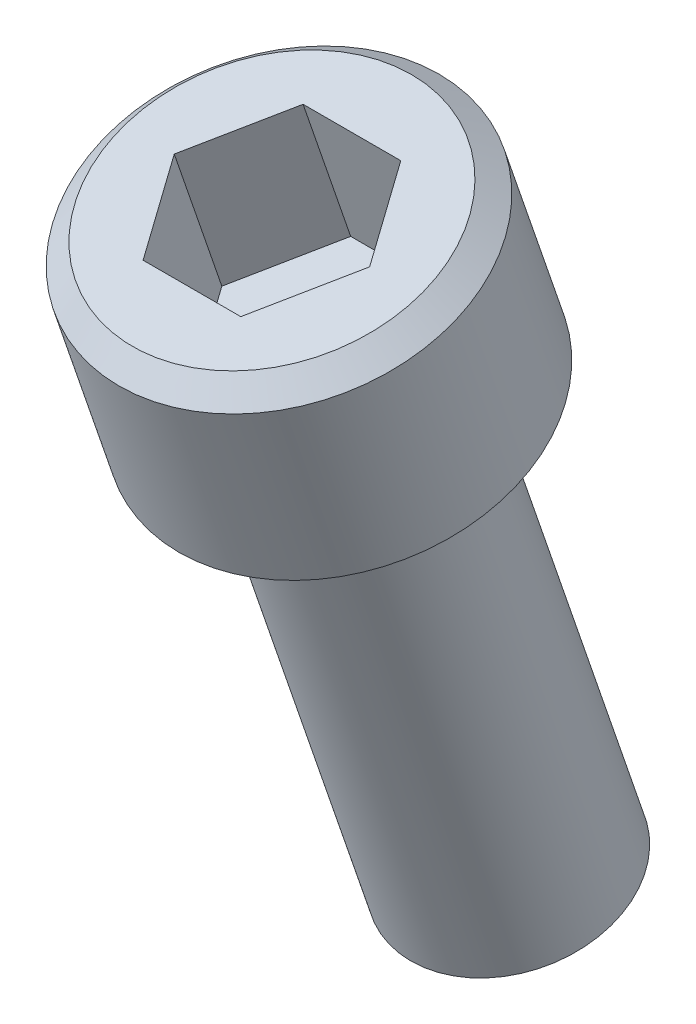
ISO-10303-21;
HEADER;
FILE_DESCRIPTION(('STEP AP214'),'2;1');
FILE_NAME('part.step','',(''),(''),'','','');
FILE_SCHEMA(('AUTOMOTIVE_DESIGN { 1 0 10303 214 1 1 1 1 }'));
ENDSEC;
DATA;
#1=APPLICATION_CONTEXT('core data for automotive mechanical design processes');
#2=APPLICATION_PROTOCOL_DEFINITION('international standard','automotive_design',2000,#1);
#3=PRODUCT_CONTEXT('',#1,'mechanical');
#4=PRODUCT('Part','Part','',(#3));
#5=PRODUCT_RELATED_PRODUCT_CATEGORY('part','',(#4));
#6=PRODUCT_DEFINITION_FORMATION('','',#4);
#7=PRODUCT_DEFINITION_CONTEXT('part definition',#1,'design');
#8=PRODUCT_DEFINITION('design','',#6,#7);
#9=PRODUCT_DEFINITION_SHAPE('','',#8);
#10=(LENGTH_UNIT() NAMED_UNIT(*) SI_UNIT(.MILLI.,.METRE.));
#11=(NAMED_UNIT(*) PLANE_ANGLE_UNIT() SI_UNIT($,.RADIAN.));
#12=(NAMED_UNIT(*) SI_UNIT($,.STERADIAN.) SOLID_ANGLE_UNIT());
#13=UNCERTAINTY_MEASURE_WITH_UNIT(LENGTH_MEASURE(1.E-05),#10,'distance_accuracy_value','');
#14=(GEOMETRIC_REPRESENTATION_CONTEXT(3) GLOBAL_UNCERTAINTY_ASSIGNED_CONTEXT((#13)) GLOBAL_UNIT_ASSIGNED_CONTEXT((#10,
#11,#12)) REPRESENTATION_CONTEXT('',''));
#15=CARTESIAN_POINT('',(0.,0.,0.));
#16=DIRECTION('',(0.,0.,1.));
#17=DIRECTION('',(1.,0.,0.));
#18=AXIS2_PLACEMENT_3D('',#15,#16,#17);
#19=CARTESIAN_POINT('',(-745.722223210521,-226.647654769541,-472.873349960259));
#20=DIRECTION('',(0.,-0.945518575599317,-0.325568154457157));
#21=DIRECTION('',(0.,0.325568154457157,-0.945518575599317));
#22=AXIS2_PLACEMENT_3D('',#19,#20,#21);
#23=PLANE('',#22);
#24=DIRECTION('',(0.500000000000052,-0.281950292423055,0.818843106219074));
#25=VECTOR('',#24,1.);
#26=CARTESIAN_POINT('',(-748.013582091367,-226.647654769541,-472.873349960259));
#27=LINE('',#26,#25);
#28=CARTESIAN_POINT('',(-748.013582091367,-226.647654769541,-472.873349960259));
#29=VERTEX_POINT('',#28);
#30=CARTESIAN_POINT('',(-746.867902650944,-227.293704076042,-470.997086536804));
#31=VERTEX_POINT('',#30);
#32=EDGE_CURVE('E142',#29,#31,#27,.T.);
#33=ORIENTED_EDGE('',*,*,#32,.T.);
#34=DIRECTION('',(1.,0.,0.));
#35=VECTOR('',#34,1.);
#36=CARTESIAN_POINT('',(-744.576543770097,-227.293704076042,-470.997086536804));
#37=LINE('',#36,#35);
#38=CARTESIAN_POINT('',(-744.576543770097,-227.293704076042,-470.997086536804));
#39=VERTEX_POINT('',#38);
#40=EDGE_CURVE('E149',#31,#39,#37,.T.);
#41=ORIENTED_EDGE('',*,*,#40,.T.);
#42=DIRECTION('',(0.500000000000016,0.281950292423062,-0.818843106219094));
#43=VECTOR('',#42,1.);
#44=CARTESIAN_POINT('',(-744.576543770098,-227.293704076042,-470.997086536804));
#45=LINE('',#44,#43);
#46=CARTESIAN_POINT('',(-743.430864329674,-226.647654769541,-472.873349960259));
#47=VERTEX_POINT('',#46);
#48=EDGE_CURVE('E153',#39,#47,#45,.T.);
#49=ORIENTED_EDGE('',*,*,#48,.T.);
#50=DIRECTION('',(-0.500000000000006,0.28195029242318,-0.818843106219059));
#51=VECTOR('',#50,1.);
#52=CARTESIAN_POINT('',(-743.430864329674,-226.647654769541,-472.873349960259));
#53=LINE('',#52,#51);
#54=CARTESIAN_POINT('',(-744.576543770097,-226.00160546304,-474.749613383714));
#55=VERTEX_POINT('',#54);
#56=EDGE_CURVE('E157',#47,#55,#53,.T.);
#57=ORIENTED_EDGE('',*,*,#56,.T.);
#58=DIRECTION('',(1.,0.,0.));
#59=VECTOR('',#58,1.);
#60=CARTESIAN_POINT('',(-746.867902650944,-226.00160546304,-474.749613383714));
#61=LINE('',#60,#59);
#62=CARTESIAN_POINT('',(-746.867902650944,-226.001605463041,-474.749613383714));
#63=VERTEX_POINT('',#62);
#64=EDGE_CURVE('E161',#55,#63,#61,.F.);
#65=ORIENTED_EDGE('',*,*,#64,.T.);
#66=DIRECTION('',(-0.499999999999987,-0.281950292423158,0.818843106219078));
#67=VECTOR('',#66,1.);
#68=CARTESIAN_POINT('',(-746.867902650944,-226.00160546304,-474.749613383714));
#69=LINE('',#68,#67);
#70=EDGE_CURVE('E163',#63,#29,#69,.T.);
#71=ORIENTED_EDGE('',*,*,#70,.T.);
#72=EDGE_LOOP('',(#33,#41,#49,#57,#65,#71));
#73=FACE_BOUND('',#72,.T.);
#74=ADVANCED_FACE('F17',(#73),#23,.F.);
#75=CARTESIAN_POINT('',(-748.013582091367,-226.647654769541,-472.873349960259));
#76=DIRECTION('',(-0.866025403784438,0.162784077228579,-0.47275928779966));
#77=DIRECTION('',(-0.47915033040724,0.,0.877732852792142));
#78=AXIS2_PLACEMENT_3D('',#75,#76,#77);
#79=PLANE('',#78);
#80=ORIENTED_EDGE('',*,*,#70,.F.);
#81=DIRECTION('',(0.,0.945518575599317,0.325568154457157));
#82=VECTOR('',#81,1.);
#83=CARTESIAN_POINT('',(-746.867902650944,-226.00160546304,-474.749613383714));
#84=LINE('',#83,#82);
#85=CARTESIAN_POINT('',(-746.867902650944,-222.75942226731,-473.63324018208));
#86=VERTEX_POINT('',#85);
#87=EDGE_CURVE('E159',#63,#86,#84,.T.);
#88=ORIENTED_EDGE('',*,*,#87,.T.);
#89=DIRECTION('',(0.500000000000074,0.281950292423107,-0.818843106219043));
#90=VECTOR('',#89,1.);
#91=CARTESIAN_POINT('',(-748.013582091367,-223.405471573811,-471.756976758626));
#92=LINE('',#91,#90);
#93=CARTESIAN_POINT('',(-748.013582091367,-223.405471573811,-471.756976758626));
#94=VERTEX_POINT('',#93);
#95=EDGE_CURVE('E137',#94,#86,#92,.T.);
#96=ORIENTED_EDGE('',*,*,#95,.F.);
#97=DIRECTION('',(0.,-0.945518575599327,-0.325568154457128));
#98=VECTOR('',#97,1.);
#99=CARTESIAN_POINT('',(-748.013582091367,-223.405471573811,-471.756976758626));
#100=LINE('',#99,#98);
#101=EDGE_CURVE('E144',#94,#29,#100,.T.);
#102=ORIENTED_EDGE('',*,*,#101,.T.);
#103=EDGE_LOOP('',(#80,#88,#96,#102));
#104=FACE_BOUND('',#103,.T.);
#105=ADVANCED_FACE('F305',(#104),#79,.F.);
#106=CARTESIAN_POINT('',(-746.867902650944,-226.00160546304,-474.749613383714));
#107=DIRECTION('',(0.,0.325568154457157,-0.945518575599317));
#108=DIRECTION('',(0.,0.945518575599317,0.325568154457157));
#109=AXIS2_PLACEMENT_3D('',#106,#107,#108);
#110=PLANE('',#109);
#111=ORIENTED_EDGE('',*,*,#64,.F.);
#112=DIRECTION('',(0.,0.945518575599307,0.325568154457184));
#113=VECTOR('',#112,1.);
#114=CARTESIAN_POINT('',(-744.576543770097,-226.00160546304,-474.749613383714));
#115=LINE('',#114,#113);
#116=CARTESIAN_POINT('',(-744.576543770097,-222.75942226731,-473.63324018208));
#117=VERTEX_POINT('',#116);
#118=EDGE_CURVE('E155',#55,#117,#115,.T.);
#119=ORIENTED_EDGE('',*,*,#118,.T.);
#120=DIRECTION('',(1.,0.,0.));
#121=VECTOR('',#120,1.);
#122=CARTESIAN_POINT('',(-745.722223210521,-222.75942226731,-473.63324018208));
#123=LINE('',#122,#121);
#124=EDGE_CURVE('E134',#86,#117,#123,.T.);
#125=ORIENTED_EDGE('',*,*,#124,.F.);
#126=ORIENTED_EDGE('',*,*,#87,.F.);
#127=EDGE_LOOP('',(#111,#119,#125,#126));
#128=FACE_BOUND('',#127,.T.);
#129=ADVANCED_FACE('F295',(#128),#110,.F.);
#130=CARTESIAN_POINT('',(-744.576543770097,-226.00160546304,-474.749613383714));
#131=DIRECTION('',(0.866025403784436,0.16278407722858,-0.472759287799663));
#132=DIRECTION('',(-0.479150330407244,0.,-0.87773285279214));
#133=AXIS2_PLACEMENT_3D('',#130,#131,#132);
#134=PLANE('',#133);
#135=ORIENTED_EDGE('',*,*,#56,.F.);
#136=DIRECTION('',(0.,0.945518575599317,0.325568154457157));
#137=VECTOR('',#136,1.);
#138=CARTESIAN_POINT('',(-743.430864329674,-226.647654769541,-472.873349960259));
#139=LINE('',#138,#137);
#140=CARTESIAN_POINT('',(-743.430864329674,-223.405471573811,-471.756976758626));
#141=VERTEX_POINT('',#140);
#142=EDGE_CURVE('E151',#47,#141,#139,.T.);
#143=ORIENTED_EDGE('',*,*,#142,.T.);
#144=DIRECTION('',(0.500000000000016,-0.281950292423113,0.818843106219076));
#145=VECTOR('',#144,1.);
#146=CARTESIAN_POINT('',(-744.576543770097,-222.75942226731,-473.63324018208));
#147=LINE('',#146,#145);
#148=EDGE_CURVE('E131',#117,#141,#147,.T.);
#149=ORIENTED_EDGE('',*,*,#148,.F.);
#150=ORIENTED_EDGE('',*,*,#118,.F.);
#151=EDGE_LOOP('',(#135,#143,#149,#150));
#152=FACE_BOUND('',#151,.T.);
#153=ADVANCED_FACE('F285',(#152),#134,.F.);
#154=CARTESIAN_POINT('',(-743.430864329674,-226.647654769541,-472.873349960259));
#155=DIRECTION('',(0.866025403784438,-0.162784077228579,0.47275928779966));
#156=DIRECTION('',(0.47915033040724,0.,-0.877732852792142));
#157=AXIS2_PLACEMENT_3D('',#154,#155,#156);
#158=PLANE('',#157);
#159=ORIENTED_EDGE('',*,*,#48,.F.);
#160=DIRECTION('',(0.,-0.945518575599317,-0.325568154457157));
#161=VECTOR('',#160,1.);
#162=CARTESIAN_POINT('',(-744.576543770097,-227.293704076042,-470.997086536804));
#163=LINE('',#162,#161);
#164=CARTESIAN_POINT('',(-744.576543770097,-224.051520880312,-469.880713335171));
#165=VERTEX_POINT('',#164);
#166=EDGE_CURVE('E147',#39,#165,#163,.F.);
#167=ORIENTED_EDGE('',*,*,#166,.T.);
#168=DIRECTION('',(-0.499999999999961,-0.281950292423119,0.818843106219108));
#169=VECTOR('',#168,1.);
#170=CARTESIAN_POINT('',(-743.430864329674,-223.405471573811,-471.756976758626));
#171=LINE('',#170,#169);
#172=EDGE_CURVE('E128',#141,#165,#171,.T.);
#173=ORIENTED_EDGE('',*,*,#172,.F.);
#174=ORIENTED_EDGE('',*,*,#142,.F.);
#175=EDGE_LOOP('',(#159,#167,#173,#174));
#176=FACE_BOUND('',#175,.T.);
#177=ADVANCED_FACE('F275',(#176),#158,.F.);
#178=CARTESIAN_POINT('',(-744.576543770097,-227.293704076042,-470.997086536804));
#179=DIRECTION('',(0.,-0.325568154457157,0.945518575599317));
#180=DIRECTION('',(0.,-0.945518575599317,-0.325568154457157));
#181=AXIS2_PLACEMENT_3D('',#178,#179,#180);
#182=PLANE('',#181);
#183=ORIENTED_EDGE('',*,*,#40,.F.);
#184=DIRECTION('',(0.,0.945518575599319,0.32556815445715));
#185=VECTOR('',#184,1.);
#186=CARTESIAN_POINT('',(-746.867902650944,-227.293704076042,-470.997086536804));
#187=LINE('',#186,#185);
#188=CARTESIAN_POINT('',(-746.867902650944,-224.051520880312,-469.880713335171));
#189=VERTEX_POINT('',#188);
#190=EDGE_CURVE('E140',#31,#189,#187,.T.);
#191=ORIENTED_EDGE('',*,*,#190,.T.);
#192=DIRECTION('',(1.,0.,0.));
#193=VECTOR('',#192,1.);
#194=CARTESIAN_POINT('',(-745.722223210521,-224.051520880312,-469.880713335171));
#195=LINE('',#194,#193);
#196=EDGE_CURVE('E125',#165,#189,#195,.F.);
#197=ORIENTED_EDGE('',*,*,#196,.F.);
#198=ORIENTED_EDGE('',*,*,#166,.F.);
#199=EDGE_LOOP('',(#183,#191,#197,#198));
#200=FACE_BOUND('',#199,.T.);
#201=ADVANCED_FACE('F265',(#200),#182,.F.);
#202=CARTESIAN_POINT('',(-746.867902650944,-227.293704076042,-470.997086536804));
#203=DIRECTION('',(-0.866025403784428,-0.162784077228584,0.472759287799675));
#204=DIRECTION('',(0.479150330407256,0.,0.877732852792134));
#205=AXIS2_PLACEMENT_3D('',#202,#203,#204);
#206=PLANE('',#205);
#207=ORIENTED_EDGE('',*,*,#32,.F.);
#208=ORIENTED_EDGE('',*,*,#101,.F.);
#209=DIRECTION('',(-0.499999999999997,0.281950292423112,-0.818843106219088));
#210=VECTOR('',#209,1.);
#211=CARTESIAN_POINT('',(-746.867902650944,-224.051520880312,-469.880713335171));
#212=LINE('',#211,#210);
#213=EDGE_CURVE('E122',#189,#94,#212,.T.);
#214=ORIENTED_EDGE('',*,*,#213,.F.);
#215=ORIENTED_EDGE('',*,*,#190,.F.);
#216=EDGE_LOOP('',(#207,#208,#214,#215));
#217=FACE_BOUND('',#216,.T.);
#218=ADVANCED_FACE('F255',(#217),#206,.F.);
#219=CARTESIAN_POINT('',(-745.722223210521,-223.405471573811,-471.756976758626));
#220=DIRECTION('',(0.,0.945518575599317,0.325568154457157));
#221=DIRECTION('',(0.,-0.325568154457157,0.945518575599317));
#222=AXIS2_PLACEMENT_3D('',#219,#220,#221);
#223=PLANE('',#222);
#224=ORIENTED_EDGE('',*,*,#196,.T.);
#225=ORIENTED_EDGE('',*,*,#213,.T.);
#226=ORIENTED_EDGE('',*,*,#95,.T.);
#227=ORIENTED_EDGE('',*,*,#124,.T.);
#228=ORIENTED_EDGE('',*,*,#148,.T.);
#229=ORIENTED_EDGE('',*,*,#172,.T.);
#230=EDGE_LOOP('',(#224,#225,#226,#227,#228,#229));
#231=FACE_BOUND('',#230,.T.);
#232=CARTESIAN_POINT('',(-745.722223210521,-223.405471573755,-471.756976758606));
#233=DIRECTION('',(0.,-0.945518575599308,-0.325568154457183));
#234=DIRECTION('',(0.,0.325568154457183,-0.945518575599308));
#235=AXIS2_PLACEMENT_3D('',#232,#233,#234);
#236=CIRCLE('',#235,3.46074999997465);
#237=CARTESIAN_POINT('',(-745.722223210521,-222.278761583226,-475.029180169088));
#238=VERTEX_POINT('',#237);
#239=EDGE_CURVE('E22',#238,#238,#236,.T.);
#240=ORIENTED_EDGE('',*,*,#239,.F.);
#241=EDGE_LOOP('',(#240));
#242=FACE_BOUND('',#241,.T.);
#243=ADVANCED_FACE('F245',(#231,#242),#223,.T.);
#244=CARTESIAN_POINT('',(-745.722223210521,-223.885795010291,-471.922365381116));
#245=DIRECTION('',(0.,-0.945518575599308,-0.325568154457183));
#246=DIRECTION('',(0.,0.325568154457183,-0.945518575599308));
#247=AXIS2_PLACEMENT_3D('',#244,#245,#246);
#248=CONICAL_SURFACE('',#247,3.96875000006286,0.785398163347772);
#249=ORIENTED_EDGE('',*,*,#239,.T.);
#250=EDGE_LOOP('',(#249));
#251=FACE_BOUND('',#250,.T.);
#252=CARTESIAN_POINT('',(-745.722223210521,-223.885795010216,-471.92236538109));
#253=DIRECTION('',(0.,0.945518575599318,0.325568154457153));
#254=DIRECTION('',(0.,-0.325568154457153,0.945518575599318));
#255=AXIS2_PLACEMENT_3D('',#252,#253,#254);
#256=CIRCLE('',#255,3.96875000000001);
#257=CARTESIAN_POINT('',(-745.722223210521,-225.177893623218,-468.16983853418));
#258=VERTEX_POINT('',#257);
#259=EDGE_CURVE('E94',#258,#258,#256,.F.);
#260=ORIENTED_EDGE('',*,*,#259,.F.);
#261=EDGE_LOOP('',(#260));
#262=FACE_BOUND('',#261,.T.);
#263=ADVANCED_FACE('F235',(#251,#262),#248,.T.);
#264=CARTESIAN_POINT('',(-745.722223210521,-227.968544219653,-473.328168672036));
#265=DIRECTION('',(0.,0.945518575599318,0.325568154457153));
#266=DIRECTION('',(0.,-0.325568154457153,0.945518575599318));
#267=AXIS2_PLACEMENT_3D('',#264,#265,#266);
#268=CYLINDRICAL_SURFACE('',#267,3.96875000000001);
#269=CARTESIAN_POINT('',(-745.722223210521,-227.968544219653,-473.328168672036));
#270=DIRECTION('',(0.,0.945518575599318,0.325568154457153));
#271=DIRECTION('',(0.,-0.325568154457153,0.945518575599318));
#272=AXIS2_PLACEMENT_3D('',#269,#270,#271);
#273=CIRCLE('',#272,3.96875000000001);
#274=CARTESIAN_POINT('',(-745.722223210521,-229.260642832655,-469.575641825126));
#275=VERTEX_POINT('',#274);
#276=EDGE_CURVE('E102',#275,#275,#273,.F.);
#277=ORIENTED_EDGE('',*,*,#276,.F.);
#278=EDGE_LOOP('',(#277));
#279=FACE_BOUND('',#278,.T.);
#280=ORIENTED_EDGE('',*,*,#259,.T.);
#281=EDGE_LOOP('',(#280));
#282=FACE_BOUND('',#281,.T.);
#283=ADVANCED_FACE('F226',(#279,#282),#268,.T.);
#284=CARTESIAN_POINT('',(-745.722223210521,-239.976630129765,-477.462884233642));
#285=DIRECTION('',(0.,-0.945518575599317,-0.325568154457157));
#286=DIRECTION('',(0.,0.325568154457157,-0.945518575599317));
#287=AXIS2_PLACEMENT_3D('',#284,#285,#286);
#288=PLANE('',#287);
#289=CARTESIAN_POINT('',(-745.722223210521,-239.976630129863,-477.462884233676));
#290=DIRECTION('',(0.,0.945518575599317,0.325568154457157));
#291=DIRECTION('',(0.,-0.325568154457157,0.945518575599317));
#292=AXIS2_PLACEMENT_3D('',#289,#290,#291);
#293=CIRCLE('',#292,1.90499999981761);
#294=CARTESIAN_POINT('',(-745.722223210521,-239.356422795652,-479.264097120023));
#295=VERTEX_POINT('',#294);
#296=CARTESIAN_POINT('',(-745.722223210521,-240.596837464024,-475.661671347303));
#297=VERTEX_POINT('',#296);
#298=EDGE_CURVE('E95',#295,#297,#293,.T.);
#299=ORIENTED_EDGE('',*,*,#298,.F.);
#300=CARTESIAN_POINT('',(-745.722223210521,-239.976630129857,-477.462884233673));
#301=DIRECTION('',(0.,0.945518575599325,0.325568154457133));
#302=DIRECTION('',(0.,-0.325568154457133,0.945518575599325));
#303=AXIS2_PLACEMENT_3D('',#300,#301,#302);
#304=CIRCLE('',#303,1.90499999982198);
#305=EDGE_CURVE('E87',#297,#295,#304,.T.);
#306=ORIENTED_EDGE('',*,*,#305,.F.);
#307=EDGE_LOOP('',(#299,#306));
#308=FACE_BOUND('',#307,.T.);
#309=ADVANCED_FACE('F96',(#308),#288,.T.);
#310=CARTESIAN_POINT('',(-745.722223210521,-239.496306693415,-477.297495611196));
#311=DIRECTION('',(0.,0.945518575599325,0.325568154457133));
#312=DIRECTION('',(0.,-0.325568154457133,0.945518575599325));
#313=AXIS2_PLACEMENT_3D('',#310,#311,#312);
#314=CONICAL_SURFACE('',#313,2.4129999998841,0.785398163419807);
#315=DIRECTION('',(0.,-0.438371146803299,-0.898794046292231));
#316=VECTOR('',#315,1.);
#317=CARTESIAN_POINT('',(-745.722223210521,243369.960564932,499000.));
#318=LINE('',#317,#316);
#319=CARTESIAN_POINT('',(-745.722223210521,-240.281902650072,-475.015959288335));
#320=VERTEX_POINT('',#319);
#321=EDGE_CURVE('E91',#297,#320,#318,.F.);
#322=ORIENTED_EDGE('',*,*,#321,.F.);
#323=ORIENTED_EDGE('',*,*,#305,.T.);
#324=DIRECTION('',(0.,-0.898794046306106,0.438371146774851));
#325=VECTOR('',#324,1.);
#326=CARTESIAN_POINT('',(-745.722223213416,499236.305256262,-244089.821483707));
#327=LINE('',#326,#325);
#328=CARTESIAN_POINT('',(-745.722223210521,-238.710710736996,-479.579031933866));
#329=VERTEX_POINT('',#328);
#330=EDGE_CURVE('E90',#329,#295,#327,.T.);
#331=ORIENTED_EDGE('',*,*,#330,.F.);
#332=CARTESIAN_POINT('',(-745.722223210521,-239.496306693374,-477.297495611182));
#333=DIRECTION('',(0.,0.945518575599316,0.325568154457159));
#334=DIRECTION('',(0.,-0.325568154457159,0.945518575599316));
#335=AXIS2_PLACEMENT_3D('',#332,#333,#334);
#336=CIRCLE('',#335,2.41300000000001);
#337=EDGE_CURVE('E37',#320,#329,#336,.T.);
#338=ORIENTED_EDGE('',*,*,#337,.F.);
#339=EDGE_LOOP('',(#322,#323,#331,#338));
#340=FACE_BOUND('',#339,.T.);
#341=ADVANCED_FACE('F88',(#340),#314,.T.);
#342=CARTESIAN_POINT('',(-745.722223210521,-227.968544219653,-473.328168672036));
#343=DIRECTION('',(0.,-0.945518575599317,-0.325568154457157));
#344=DIRECTION('',(0.,0.325568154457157,-0.945518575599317));
#345=AXIS2_PLACEMENT_3D('',#342,#343,#344);
#346=PLANE('',#345);
#347=ORIENTED_EDGE('',*,*,#276,.T.);
#348=EDGE_LOOP('',(#347));
#349=FACE_BOUND('',#348,.T.);
#350=CARTESIAN_POINT('',(-745.722223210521,-228.869912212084,-470.710405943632));
#351=CARTESIAN_POINT('',(-745.19435945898,-228.86987929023,-470.710501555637));
#352=CARTESIAN_POINT('',(-744.703116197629,-228.806625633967,-470.894203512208));
#353=CARTESIAN_POINT('',(-744.170822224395,-228.738086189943,-471.093256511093));
#354=CARTESIAN_POINT('',(-743.764527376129,-228.605907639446,-471.477130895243));
#355=CARTESIAN_POINT('',(-743.359676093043,-228.474198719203,-471.859641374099));
#356=CARTESIAN_POINT('',(-743.1480113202,-228.300333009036,-472.364584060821));
#357=CARTESIAN_POINT('',(-742.953819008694,-228.14081953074,-472.827844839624));
#358=CARTESIAN_POINT('',(-742.953623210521,-227.968544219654,-473.328168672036));
#359=CARTESIAN_POINT('',(-742.95342816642,-227.796932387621,-473.826565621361));
#360=CARTESIAN_POINT('',(-743.148011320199,-227.636755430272,-474.29175328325));
#361=CARTESIAN_POINT('',(-743.358533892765,-227.463457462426,-474.795047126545));
#362=CARTESIAN_POINT('',(-743.764527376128,-227.331180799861,-475.179206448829));
#363=CARTESIAN_POINT('',(-744.169078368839,-227.199374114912,-475.562000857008));
#364=CARTESIAN_POINT('',(-744.703116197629,-227.13046280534,-475.762133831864));
#365=CARTESIAN_POINT('',(-745.193308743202,-227.067209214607,-475.945835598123));
#366=CARTESIAN_POINT('',(-745.722223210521,-227.067176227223,-475.94593140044));
#367=B_SPLINE_CURVE_WITH_KNOTS('',2,(#350,#351,#352,#353,#354,#355,#356,#357,#358,#359,#360,
#361,#362,#363,#364,#365,#366),.UNSPECIFIED.,.F.,.F.,(3,2,2,2,2,2,2,2,3),(0.,0.125,0.25,0.375,
0.5,0.625,0.75,0.875,1.),.UNSPECIFIED.);
#368=CARTESIAN_POINT('',(-745.722223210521,-228.869912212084,-470.710405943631));
#369=VERTEX_POINT('',#368);
#370=CARTESIAN_POINT('',(-745.722223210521,-227.067176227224,-475.94593140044));
#371=VERTEX_POINT('',#370);
#372=EDGE_CURVE('E93',#369,#371,#367,.T.);
#373=ORIENTED_EDGE('',*,*,#372,.T.);
#374=CARTESIAN_POINT('',(-745.722223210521,-228.869912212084,-470.710405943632));
#375=CARTESIAN_POINT('',(-745.75125647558,-228.869910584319,-470.710410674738));
#376=CARTESIAN_POINT('',(-745.78028940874,-228.869761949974,-470.710842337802));
#377=CARTESIAN_POINT('',(-745.838326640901,-228.86917143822,-470.712557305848));
#378=CARTESIAN_POINT('',(-745.867330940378,-228.868729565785,-470.713840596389));
#379=CARTESIAN_POINT('',(-745.925283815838,-228.867553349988,-470.717256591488));
#380=CARTESIAN_POINT('',(-745.954232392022,-228.866819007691,-470.719389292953));
#381=CARTESIAN_POINT('',(-746.012043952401,-228.865056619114,-470.724507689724));
#382=CARTESIAN_POINT('',(-746.040906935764,-228.864028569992,-470.727493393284));
#383=CARTESIAN_POINT('',(-746.112521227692,-228.861118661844,-470.735944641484));
#384=CARTESIAN_POINT('',(-746.155209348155,-228.859064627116,-470.741910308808));
#385=CARTESIAN_POINT('',(-746.201645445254,-228.856448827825,-470.749507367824));
#386=CARTESIAN_POINT('',(-746.205579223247,-228.856224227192,-470.750159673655));
#387=CARTESIAN_POINT('',(-746.245859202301,-228.853892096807,-470.756932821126));
#388=CARTESIAN_POINT('',(-746.282068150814,-228.8515258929,-470.763804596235));
#389=CARTESIAN_POINT('',(-746.348599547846,-228.84673114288,-470.777729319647));
#390=CARTESIAN_POINT('',(-746.378967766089,-228.844368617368,-470.784590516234));
#391=CARTESIAN_POINT('',(-746.447678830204,-228.838618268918,-470.801290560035));
#392=CARTESIAN_POINT('',(-746.485940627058,-228.835126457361,-470.811431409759));
#393=CARTESIAN_POINT('',(-746.545350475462,-228.829253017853,-470.828488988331));
#394=CARTESIAN_POINT('',(-746.566670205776,-228.827053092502,-470.834877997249));
#395=CARTESIAN_POINT('',(-746.611044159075,-228.822280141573,-470.848739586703));
#396=CARTESIAN_POINT('',(-746.634082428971,-228.819691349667,-470.856257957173));
#397=CARTESIAN_POINT('',(-746.6871386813,-228.813474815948,-470.874312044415));
#398=CARTESIAN_POINT('',(-746.71707826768,-228.809775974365,-470.885054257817));
#399=CARTESIAN_POINT('',(-746.775724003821,-228.802154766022,-470.907187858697));
#400=CARTESIAN_POINT('',(-746.804441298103,-228.798241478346,-470.918552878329));
#401=CARTESIAN_POINT('',(-746.861459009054,-228.790105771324,-470.942180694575));
#402=CARTESIAN_POINT('',(-746.889759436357,-228.78588335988,-470.954443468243));
#403=CARTESIAN_POINT('',(-746.945912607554,-228.777134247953,-470.979852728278));
#404=CARTESIAN_POINT('',(-746.973765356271,-228.772607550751,-470.992999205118));
#405=CARTESIAN_POINT('',(-747.02899252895,-228.763254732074,-471.020161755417));
#406=CARTESIAN_POINT('',(-747.056366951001,-228.758428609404,-471.034177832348));
#407=CARTESIAN_POINT('',(-747.11060819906,-228.748482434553,-471.063063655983));
#408=CARTESIAN_POINT('',(-747.137475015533,-228.74336237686,-471.077933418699));
#409=CARTESIAN_POINT('',(-747.190669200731,-228.732833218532,-471.108512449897));
#410=CARTESIAN_POINT('',(-747.216996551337,-228.727424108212,-471.124221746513));
#411=CARTESIAN_POINT('',(-747.274301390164,-228.715215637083,-471.159678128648));
#412=CARTESIAN_POINT('',(-747.305155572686,-228.70835462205,-471.179604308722));
#413=CARTESIAN_POINT('',(-747.356003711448,-228.696540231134,-471.21391645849));
#414=CARTESIAN_POINT('',(-747.376243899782,-228.691698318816,-471.227978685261));
#415=CARTESIAN_POINT('',(-747.446318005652,-228.674428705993,-471.278133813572));
#416=CARTESIAN_POINT('',(-747.495032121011,-228.661509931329,-471.315652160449));
#417=CARTESIAN_POINT('',(-747.57318911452,-228.639165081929,-471.380545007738));
#418=CARTESIAN_POINT('',(-747.60351048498,-228.630061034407,-471.406984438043));
#419=CARTESIAN_POINT('',(-747.638834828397,-228.61902473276,-471.439036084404));
#420=CARTESIAN_POINT('',(-747.644387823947,-228.617276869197,-471.44411225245));
#421=CARTESIAN_POINT('',(-747.665163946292,-228.610693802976,-471.463230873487));
#422=CARTESIAN_POINT('',(-747.680269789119,-228.605819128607,-471.477387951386));
#423=CARTESIAN_POINT('',(-747.718467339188,-228.593206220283,-471.514018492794));
#424=CARTESIAN_POINT('',(-747.741311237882,-228.585388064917,-471.536724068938));
#425=CARTESIAN_POINT('',(-747.784646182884,-228.570021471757,-471.581351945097));
#426=CARTESIAN_POINT('',(-747.805192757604,-228.562489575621,-471.603226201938));
#427=CARTESIAN_POINT('',(-747.849454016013,-228.545710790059,-471.651955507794));
#428=CARTESIAN_POINT('',(-747.873001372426,-228.53641684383,-471.678947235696));
#429=CARTESIAN_POINT('',(-747.901811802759,-228.524564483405,-471.713369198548));
#430=CARTESIAN_POINT('',(-747.907626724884,-228.522146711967,-471.720390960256));
#431=CARTESIAN_POINT('',(-747.940030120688,-228.508524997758,-471.759951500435));
#432=CARTESIAN_POINT('',(-747.965818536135,-228.497116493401,-471.793084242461));
#433=CARTESIAN_POINT('',(-748.006731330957,-228.478085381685,-471.848354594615));
#434=CARTESIAN_POINT('',(-748.022357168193,-228.470575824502,-471.870163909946));
#435=CARTESIAN_POINT('',(-748.055133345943,-228.454295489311,-471.917445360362));
#436=CARTESIAN_POINT('',(-748.072172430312,-228.445500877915,-471.942986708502));
#437=CARTESIAN_POINT('',(-748.107413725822,-228.426590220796,-471.997907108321));
#438=CARTESIAN_POINT('',(-748.125487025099,-228.416448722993,-472.027360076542));
#439=CARTESIAN_POINT('',(-748.162374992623,-228.394782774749,-472.090282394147));
#440=CARTESIAN_POINT('',(-748.181042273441,-228.383231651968,-472.123829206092));
#441=CARTESIAN_POINT('',(-748.211182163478,-228.363553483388,-472.180978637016));
#442=CARTESIAN_POINT('',(-748.223069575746,-228.355493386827,-472.204386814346));
#443=CARTESIAN_POINT('',(-748.246783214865,-228.338779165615,-472.252928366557));
#444=CARTESIAN_POINT('',(-748.258563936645,-228.330118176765,-472.278081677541));
#445=CARTESIAN_POINT('',(-748.278314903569,-228.314959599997,-472.322105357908));
#446=CARTESIAN_POINT('',(-748.286476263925,-228.308488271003,-472.340899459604));
#447=CARTESIAN_POINT('',(-748.305205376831,-228.293139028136,-472.385476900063));
#448=CARTESIAN_POINT('',(-748.315578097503,-228.284235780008,-472.411333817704));
#449=CARTESIAN_POINT('',(-748.335462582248,-228.26632833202,-472.463340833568));
#450=CARTESIAN_POINT('',(-748.344974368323,-228.257324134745,-472.489490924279));
#451=CARTESIAN_POINT('',(-748.36312867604,-228.239223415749,-472.54205922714));
#452=CARTESIAN_POINT('',(-748.371771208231,-228.230126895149,-472.56847743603));
#453=CARTESIAN_POINT('',(-748.388178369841,-228.211850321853,-472.621556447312));
#454=CARTESIAN_POINT('',(-748.39594299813,-228.20267026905,-472.648217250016));
#455=CARTESIAN_POINT('',(-748.410587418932,-228.184235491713,-472.701755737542));
#456=CARTESIAN_POINT('',(-748.417467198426,-228.174980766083,-472.728633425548));
#457=CARTESIAN_POINT('',(-748.430333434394,-228.156405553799,-472.78257982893));
#458=CARTESIAN_POINT('',(-748.436319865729,-228.147085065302,-472.80964854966));
#459=CARTESIAN_POINT('',(-748.447965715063,-228.127433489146,-472.866721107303));
#460=CARTESIAN_POINT('',(-748.453529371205,-228.117096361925,-472.896742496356));
#461=CARTESIAN_POINT('',(-748.462583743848,-228.098338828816,-472.951218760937));
#462=CARTESIAN_POINT('',(-748.466267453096,-228.089928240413,-472.975645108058));
#463=CARTESIAN_POINT('',(-748.473250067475,-228.072117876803,-473.027370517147));
#464=CARTESIAN_POINT('',(-748.476457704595,-228.06271428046,-473.054680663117));
#465=CARTESIAN_POINT('',(-748.481934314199,-228.043878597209,-473.109383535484));
#466=CARTESIAN_POINT('',(-748.484203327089,-228.034446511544,-473.136776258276));
#467=CARTESIAN_POINT('',(-748.487797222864,-228.015563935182,-473.191615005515));
#468=CARTESIAN_POINT('',(-748.489122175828,-228.006113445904,-473.219061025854));
#469=CARTESIAN_POINT('',(-748.490831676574,-227.987204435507,-473.273976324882));
#470=CARTESIAN_POINT('',(-748.491216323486,-227.977745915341,-473.301445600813));
#471=CARTESIAN_POINT('',(-748.491030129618,-227.959024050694,-473.355817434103));
#472=CARTESIAN_POINT('',(-748.490478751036,-227.949760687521,-473.382720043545));
#473=CARTESIAN_POINT('',(-748.488477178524,-227.93085732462,-473.437619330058));
#474=CARTESIAN_POINT('',(-748.486990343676,-227.921217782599,-473.465614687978));
#475=CARTESIAN_POINT('',(-748.481601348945,-227.89348284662,-473.546162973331));
#476=CARTESIAN_POINT('',(-748.476724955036,-227.875404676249,-473.59866579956));
#477=CARTESIAN_POINT('',(-748.464365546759,-227.842258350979,-473.694930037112));
#478=CARTESIAN_POINT('',(-748.457420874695,-227.827169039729,-473.738752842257));
#479=CARTESIAN_POINT('',(-748.44271789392,-227.799992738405,-473.817678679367));
#480=CARTESIAN_POINT('',(-748.435367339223,-227.787881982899,-473.852850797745));
#481=CARTESIAN_POINT('',(-748.419684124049,-227.764577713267,-473.920531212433));
#482=CARTESIAN_POINT('',(-748.411450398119,-227.753377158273,-473.953059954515));
#483=CARTESIAN_POINT('',(-748.394784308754,-227.732480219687,-474.013749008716));
#484=CARTESIAN_POINT('',(-748.386505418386,-227.722770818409,-474.041947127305));
#485=CARTESIAN_POINT('',(-748.368952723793,-227.70344782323,-474.098065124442));
#486=CARTESIAN_POINT('',(-748.359678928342,-227.693834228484,-474.125985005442));
#487=CARTESIAN_POINT('',(-748.340147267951,-227.674713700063,-474.181515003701));
#488=CARTESIAN_POINT('',(-748.329889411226,-227.665206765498,-474.209125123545));
#489=CARTESIAN_POINT('',(-748.308401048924,-227.646310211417,-474.264004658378));
#490=CARTESIAN_POINT('',(-748.297170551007,-227.636920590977,-474.29127407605));
#491=CARTESIAN_POINT('',(-748.273749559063,-227.61826920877,-474.345441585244));
#492=CARTESIAN_POINT('',(-748.261559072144,-227.609007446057,-474.372339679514));
#493=CARTESIAN_POINT('',(-748.236231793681,-227.59062217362,-474.425734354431));
#494=CARTESIAN_POINT('',(-748.223095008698,-227.581498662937,-474.452230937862));
#495=CARTESIAN_POINT('',(-748.195889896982,-227.563400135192,-474.504792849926));
#496=CARTESIAN_POINT('',(-748.181821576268,-227.554425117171,-474.530858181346));
#497=CARTESIAN_POINT('',(-748.152769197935,-227.536633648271,-474.582528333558));
#498=CARTESIAN_POINT('',(-748.1377851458,-227.527817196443,-474.608133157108));
#499=CARTESIAN_POINT('',(-748.106918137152,-227.510352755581,-474.658853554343));
#500=CARTESIAN_POINT('',(-748.0910351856,-227.501704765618,-474.683969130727));
#501=CARTESIAN_POINT('',(-748.058388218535,-227.484586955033,-474.733682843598));
#502=CARTESIAN_POINT('',(-748.041624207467,-227.476117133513,-474.758280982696));
#503=CARTESIAN_POINT('',(-748.007233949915,-227.459365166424,-474.806932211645));
#504=CARTESIAN_POINT('',(-747.989607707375,-227.451083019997,-474.830985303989));
#505=CARTESIAN_POINT('',(-747.953512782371,-227.434715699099,-474.878519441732));
#506=CARTESIAN_POINT('',(-747.935044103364,-227.42663052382,-474.902000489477));
#507=CARTESIAN_POINT('',(-747.897285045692,-227.41066622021,-474.948364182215));
#508=CARTESIAN_POINT('',(-747.877994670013,-227.40278709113,-474.97124682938));
#509=CARTESIAN_POINT('',(-747.838613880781,-227.38724372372,-475.016388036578));
#510=CARTESIAN_POINT('',(-747.818523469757,-227.379579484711,-475.038646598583));
#511=CARTESIAN_POINT('',(-747.777565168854,-227.364474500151,-475.082514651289));
#512=CARTESIAN_POINT('',(-747.756697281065,-227.357033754,-475.104124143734));
#513=CARTESIAN_POINT('',(-747.714207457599,-227.342384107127,-475.146669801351));
#514=CARTESIAN_POINT('',(-747.692585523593,-227.335175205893,-475.167605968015));
#515=CARTESIAN_POINT('',(-747.648611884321,-227.320997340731,-475.208781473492));
#516=CARTESIAN_POINT('',(-747.626260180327,-227.314028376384,-475.229020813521));
#517=CARTESIAN_POINT('',(-747.580852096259,-227.300338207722,-475.268779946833));
#518=CARTESIAN_POINT('',(-747.557795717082,-227.293617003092,-475.288299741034));
#519=CARTESIAN_POINT('',(-747.511004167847,-227.280429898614,-475.326597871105));
#520=CARTESIAN_POINT('',(-747.487268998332,-227.273963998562,-475.345376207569));
#521=CARTESIAN_POINT('',(-747.439146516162,-227.261294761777,-475.382170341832));
#522=CARTESIAN_POINT('',(-747.414759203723,-227.255091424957,-475.400186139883));
#523=CARTESIAN_POINT('',(-747.365359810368,-227.242954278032,-475.435434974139));
#524=CARTESIAN_POINT('',(-747.340347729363,-227.237020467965,-475.452668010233));
#525=CARTESIAN_POINT('',(-747.289726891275,-227.225429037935,-475.486331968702));
#526=CARTESIAN_POINT('',(-747.264118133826,-227.219771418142,-475.502762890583));
#527=CARTESIAN_POINT('',(-747.212332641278,-227.208738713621,-475.534804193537));
#528=CARTESIAN_POINT('',(-747.186155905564,-227.203363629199,-475.550414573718));
#529=CARTESIAN_POINT('',(-747.133264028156,-227.192902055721,-475.58079719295));
#530=CARTESIAN_POINT('',(-747.106548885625,-227.187815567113,-475.595569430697));
#531=CARTESIAN_POINT('',(-747.048757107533,-227.177231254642,-475.626308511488));
#532=CARTESIAN_POINT('',(-747.017602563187,-227.171778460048,-475.642144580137));
#533=CARTESIAN_POINT('',(-746.954674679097,-227.161265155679,-475.672677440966));
#534=CARTESIAN_POINT('',(-746.922901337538,-227.156204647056,-475.687374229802));
#535=CARTESIAN_POINT('',(-746.868057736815,-227.147889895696,-475.711522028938));
#536=CARTESIAN_POINT('',(-746.845128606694,-227.14453659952,-475.721260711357));
#537=CARTESIAN_POINT('',(-746.798997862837,-227.138034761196,-475.740143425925));
#538=CARTESIAN_POINT('',(-746.775796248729,-227.134886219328,-475.749287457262));
#539=CARTESIAN_POINT('',(-746.725249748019,-227.128288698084,-475.768448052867));
#540=CARTESIAN_POINT('',(-746.697858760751,-227.124877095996,-475.778356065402));
#541=CARTESIAN_POINT('',(-746.642757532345,-227.118339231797,-475.797343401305));
#542=CARTESIAN_POINT('',(-746.615047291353,-227.115212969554,-475.806422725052));
#543=CARTESIAN_POINT('',(-746.55933546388,-227.109248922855,-475.823743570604));
#544=CARTESIAN_POINT('',(-746.531333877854,-227.106411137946,-475.831985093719));
#545=CARTESIAN_POINT('',(-746.475067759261,-227.101026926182,-475.847621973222));
#546=CARTESIAN_POINT('',(-746.446803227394,-227.098480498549,-475.855017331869));
#547=CARTESIAN_POINT('',(-746.390039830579,-227.093681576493,-475.868954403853));
#548=CARTESIAN_POINT('',(-746.361540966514,-227.091429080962,-475.875496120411));
#549=CARTESIAN_POINT('',(-746.304337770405,-227.087220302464,-475.887719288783));
#550=CARTESIAN_POINT('',(-746.275633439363,-227.085264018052,-475.893400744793));
#551=CARTESIAN_POINT('',(-746.218048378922,-227.081649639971,-475.903897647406));
#552=CARTESIAN_POINT('',(-746.189167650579,-227.079991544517,-475.908713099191));
#553=CARTESIAN_POINT('',(-746.131259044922,-227.076975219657,-475.91747312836));
#554=CARTESIAN_POINT('',(-746.102231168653,-227.075616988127,-475.921417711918));
#555=CARTESIAN_POINT('',(-746.044057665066,-227.073201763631,-475.928432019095));
#556=CARTESIAN_POINT('',(-746.014912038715,-227.072144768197,-475.931501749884));
#557=CARTESIAN_POINT('',(-745.95653255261,-227.070333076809,-475.936763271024));
#558=CARTESIAN_POINT('',(-745.92729869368,-227.069578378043,-475.938955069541));
#559=CARTESIAN_POINT('',(-745.868772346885,-227.068372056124,-475.942458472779));
#560=CARTESIAN_POINT('',(-745.839479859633,-227.067920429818,-475.943770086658));
#561=CARTESIAN_POINT('',(-745.780865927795,-227.067320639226,-475.945511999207));
#562=CARTESIAN_POINT('',(-745.751544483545,-227.067172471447,-475.945942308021));
#563=CARTESIAN_POINT('',(-745.722223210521,-227.067176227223,-475.94593140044));
#564=B_SPLINE_CURVE_WITH_KNOTS('',3,(#374,#375,#376,#377,#378,#379,#380,#381,#382,#383,#384,
#385,#386,#387,#388,#389,#390,#391,#392,#393,#394,#395,#396,#397,#398,#399,#400,#401,#402,#403,
#404,#405,#406,#407,#408,#409,#410,#411,#412,#413,#414,#415,#416,#417,#418,#419,#420,#421,#422,
#423,#424,#425,#426,#427,#428,#429,#430,#431,#432,#433,#434,#435,#436,#437,#438,#439,#440,#441,
#442,#443,#444,#445,#446,#447,#448,#449,#450,#451,#452,#453,#454,#455,#456,#457,#458,#459,#460,
#461,#462,#463,#464,#465,#466,#467,#468,#469,#470,#471,#472,#473,#474,#475,#476,#477,#478,#479,
#480,#481,#482,#483,#484,#485,#486,#487,#488,#489,#490,#491,#492,#493,#494,#495,#496,#497,#498,
#499,#500,#501,#502,#503,#504,#505,#506,#507,#508,#509,#510,#511,#512,#513,#514,#515,#516,#517,
#518,#519,#520,#521,#522,#523,#524,#525,#526,#527,#528,#529,#530,#531,#532,#533,#534,#535,#536,
#537,#538,#539,#540,#541,#542,#543,#544,#545,#546,#547,#548,#549,#550,#551,#552,#553,#554,#555,
#556,#557,#558,#559,#560,#561,#562,#563),.UNSPECIFIED.,.F.,.F.,(4,2,2,2,2,2,2,2,2,2,2,2,2,2,2,2,
2,2,2,2,2,2,2,2,2,2,2,2,2,2,2,2,2,2,2,2,2,2,2,2,2,2,2,2,2,2,2,2,2,2,2,2,2,2,2,2,2,2,2,2,2,2,2,2,
2,2,2,2,2,2,2,2,2,2,2,2,2,2,2,2,2,2,2,2,2,2,2,2,2,2,2,2,2,2,4),(0.,0.0870958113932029,
0.174190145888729,0.261284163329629,0.348379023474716,0.477774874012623,0.489756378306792,
0.600510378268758,0.694165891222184,0.813332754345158,0.880422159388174,0.953529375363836,
1.04957803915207,1.14295510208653,1.23632977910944,1.3297034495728,1.42307749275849,
1.51645328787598,1.60983221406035,1.72189072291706,1.79723583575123,1.98552588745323,
2.10922745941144,2.13239913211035,2.19620166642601,2.29560964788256,2.38841940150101,
2.4994000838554,2.5276963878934,2.65815826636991,2.74172967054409,2.83752319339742,
2.94553697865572,3.0657687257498,3.14814703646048,3.23541456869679,3.29987158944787,
3.38760023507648,3.47532663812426,3.56305197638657,3.65077742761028,3.73850416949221,
3.82623337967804,3.92291797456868,4.00119295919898,4.08836101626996,4.17552532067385,
4.26268315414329,4.34983179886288,4.43519052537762,4.52412063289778,4.69124137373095,
4.83176541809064,4.9454898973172,5.05158692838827,5.14442223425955,5.23725672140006,
5.33009043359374,5.4229234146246,5.51575570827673,5.60858735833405,5.70141840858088,
5.79424890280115,5.88707888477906,5.97990839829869,6.07273748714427,6.16556619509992,
6.25839456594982,6.3512226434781,6.44405047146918,6.53687809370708,6.62970555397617,
6.72253289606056,6.81536016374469,6.90818740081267,7.00101465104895,7.09384195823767,
7.18666936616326,7.27949691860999,7.38558426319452,7.49167191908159,7.56707195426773,
7.64247209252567,7.73043798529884,7.8184038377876,7.90636955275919,7.99433503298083,
8.08230018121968,8.17026490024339,8.25822909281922,8.34619266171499,8.43415550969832,
8.52211753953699,8.6100786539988,8.69803875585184),.UNSPECIFIED.);
#565=EDGE_CURVE('E114',#369,#371,#564,.T.);
#566=ORIENTED_EDGE('',*,*,#565,.F.);
#567=EDGE_LOOP('',(#373,#566));
#568=FACE_BOUND('',#567,.T.);
#569=ADVANCED_FACE('F175',(#349,#568),#346,.T.);
#570=CARTESIAN_POINT('',(-745.722223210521,-239.496306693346,-477.297495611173));
#571=DIRECTION('',(0.,0.945518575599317,0.325568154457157));
#572=DIRECTION('',(0.,-0.325568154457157,0.945518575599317));
#573=AXIS2_PLACEMENT_3D('',#570,#571,#572);
#574=CONICAL_SURFACE('',#573,2.41299999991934,0.785398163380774);
#575=ORIENTED_EDGE('',*,*,#321,.T.);
#576=CARTESIAN_POINT('',(-745.722223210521,-239.49630669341,-477.297495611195));
#577=DIRECTION('',(0.,0.945518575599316,0.325568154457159));
#578=DIRECTION('',(0.,-0.325568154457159,0.945518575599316));
#579=AXIS2_PLACEMENT_3D('',#576,#577,#578);
#580=CIRCLE('',#579,2.41300000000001);
#581=EDGE_CURVE('E28',#329,#320,#580,.T.);
#582=ORIENTED_EDGE('',*,*,#581,.F.);
#583=ORIENTED_EDGE('',*,*,#330,.T.);
#584=ORIENTED_EDGE('',*,*,#298,.T.);
#585=EDGE_LOOP('',(#575,#582,#583,#584));
#586=FACE_BOUND('',#585,.T.);
#587=ADVANCED_FACE('F100',(#586),#574,.T.);
#588=CARTESIAN_POINT('',(-745.722223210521,-228.304770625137,-473.443940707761));
#589=DIRECTION('',(0.,0.945518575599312,0.325568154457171));
#590=DIRECTION('',(0.,-0.325568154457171,0.945518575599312));
#591=AXIS2_PLACEMENT_3D('',#588,#589,#590);
#592=TOROIDAL_SURFACE('',#591,2.76859999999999,0.355599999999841);
#593=CARTESIAN_POINT('',(-745.722223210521,-228.304770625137,-473.443940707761));
#594=DIRECTION('',(0.,0.945518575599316,0.325568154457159));
#595=DIRECTION('',(0.,-0.325568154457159,0.945518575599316));
#596=AXIS2_PLACEMENT_3D('',#593,#594,#595);
#597=CIRCLE('',#596,2.41300000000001);
#598=CARTESIAN_POINT('',(-745.722223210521,-229.090366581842,-471.16240438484));
#599=VERTEX_POINT('',#598);
#600=EDGE_CURVE('E11',#599,#599,#597,.F.);
#601=ORIENTED_EDGE('',*,*,#600,.F.);
#602=EDGE_LOOP('',(#601));
#603=FACE_BOUND('',#602,.T.);
#604=ORIENTED_EDGE('',*,*,#565,.T.);
#605=ORIENTED_EDGE('',*,*,#372,.F.);
#606=EDGE_LOOP('',(#604,#605));
#607=FACE_BOUND('',#606,.T.);
#608=ADVANCED_FACE('F19',(#603,#607),#592,.F.);
#609=CARTESIAN_POINT('',(-745.722223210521,-239.49630669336,-477.297495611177));
#610=DIRECTION('',(0.,0.945518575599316,0.325568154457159));
#611=DIRECTION('',(0.,-0.325568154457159,0.945518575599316));
#612=AXIS2_PLACEMENT_3D('',#609,#610,#611);
#613=CYLINDRICAL_SURFACE('',#612,2.41300000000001);
#614=ORIENTED_EDGE('',*,*,#337,.T.);
#615=ORIENTED_EDGE('',*,*,#581,.T.);
#616=EDGE_LOOP('',(#614,#615));
#617=FACE_BOUND('',#616,.T.);
#618=ORIENTED_EDGE('',*,*,#600,.T.);
#619=EDGE_LOOP('',(#618));
#620=FACE_BOUND('',#619,.T.);
#621=ADVANCED_FACE('F186',(#617,#620),#613,.T.);
#622=CLOSED_SHELL('',(#74,#105,#129,#153,#177,#201,#218,#243,#263,#283,#309,#341,#569,#587,#608,#621));
#623=MANIFOLD_SOLID_BREP('B1',#622);
#624=ADVANCED_BREP_SHAPE_REPRESENTATION('',(#18,#623),#14);
#625=SHAPE_DEFINITION_REPRESENTATION(#9,#624);
ENDSEC;
END-ISO-10303-21;
